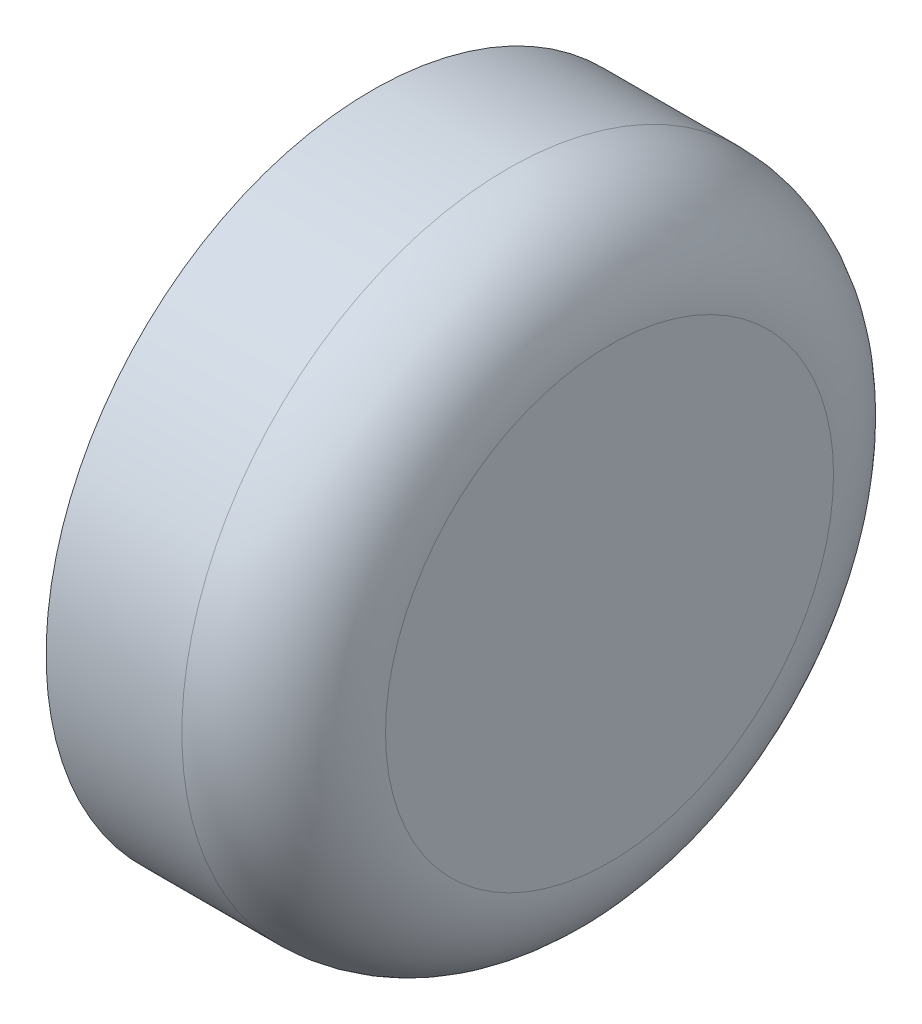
ISO-10303-21;
HEADER;
FILE_DESCRIPTION(('STEP AP214'),'2;1');
FILE_NAME('part.step','',(''),(''),'','','');
FILE_SCHEMA(('AUTOMOTIVE_DESIGN { 1 0 10303 214 1 1 1 1 }'));
ENDSEC;
DATA;
#1=APPLICATION_CONTEXT('core data for automotive mechanical design processes');
#2=APPLICATION_PROTOCOL_DEFINITION('international standard','automotive_design',2000,#1);
#3=PRODUCT_CONTEXT('',#1,'mechanical');
#4=PRODUCT('Part','Part','',(#3));
#5=PRODUCT_RELATED_PRODUCT_CATEGORY('part','',(#4));
#6=PRODUCT_DEFINITION_FORMATION('','',#4);
#7=PRODUCT_DEFINITION_CONTEXT('part definition',#1,'design');
#8=PRODUCT_DEFINITION('design','',#6,#7);
#9=PRODUCT_DEFINITION_SHAPE('','',#8);
#10=(LENGTH_UNIT() NAMED_UNIT(*) SI_UNIT(.MILLI.,.METRE.));
#11=(NAMED_UNIT(*) PLANE_ANGLE_UNIT() SI_UNIT($,.RADIAN.));
#12=(NAMED_UNIT(*) SI_UNIT($,.STERADIAN.) SOLID_ANGLE_UNIT());
#13=UNCERTAINTY_MEASURE_WITH_UNIT(LENGTH_MEASURE(1.E-05),#10,'distance_accuracy_value','');
#14=(GEOMETRIC_REPRESENTATION_CONTEXT(3) GLOBAL_UNCERTAINTY_ASSIGNED_CONTEXT((#13)) GLOBAL_UNIT_ASSIGNED_CONTEXT((#10,
#11,#12)) REPRESENTATION_CONTEXT('',''));
#15=CARTESIAN_POINT('',(0.,0.,0.));
#16=DIRECTION('',(0.,0.,1.));
#17=DIRECTION('',(1.,0.,0.));
#18=AXIS2_PLACEMENT_3D('',#15,#16,#17);
#19=CARTESIAN_POINT('',(6.319999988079,0.,1.5));
#20=DIRECTION('',(1.,0.,0.));
#21=DIRECTION('',(0.,0.,-1.));
#22=AXIS2_PLACEMENT_3D('',#19,#20,#21);
#23=PLANE('',#22);
#24=CARTESIAN_POINT('',(6.319999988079,0.,1.5));
#25=DIRECTION('',(-1.,0.,0.));
#26=DIRECTION('',(0.,0.,-1.));
#27=AXIS2_PLACEMENT_3D('',#24,#25,#26);
#28=CIRCLE('',#27,0.659999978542);
#29=CARTESIAN_POINT('',(6.319999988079,0.,0.840000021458));
#30=VERTEX_POINT('',#29);
#31=EDGE_CURVE('E24',#30,#30,#28,.T.);
#32=ORIENTED_EDGE('',*,*,#31,.F.);
#33=EDGE_LOOP('',(#32));
#34=FACE_BOUND('',#33,.T.);
#35=ADVANCED_FACE('F13',(#34),#23,.T.);
#36=CARTESIAN_POINT('',(6.019999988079,0.,1.5));
#37=DIRECTION('',(1.,0.,0.));
#38=DIRECTION('',(0.,0.,-1.));
#39=AXIS2_PLACEMENT_3D('',#36,#37,#38);
#40=TOROIDAL_SURFACE('',#39,0.659999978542,0.3);
#41=CARTESIAN_POINT('',(6.019999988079,0.,1.5));
#42=DIRECTION('',(1.,0.,0.));
#43=DIRECTION('',(0.,0.,-1.));
#44=AXIS2_PLACEMENT_3D('',#41,#42,#43);
#45=CIRCLE('',#44,0.959999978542);
#46=CARTESIAN_POINT('',(6.019999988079,0.,0.540000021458));
#47=VERTEX_POINT('',#46);
#48=EDGE_CURVE('E20',#47,#47,#45,.F.);
#49=ORIENTED_EDGE('',*,*,#48,.F.);
#50=EDGE_LOOP('',(#49));
#51=FACE_BOUND('',#50,.T.);
#52=ORIENTED_EDGE('',*,*,#31,.T.);
#53=EDGE_LOOP('',(#52));
#54=FACE_BOUND('',#53,.T.);
#55=ADVANCED_FACE('F34',(#51,#54),#40,.T.);
#56=CARTESIAN_POINT('',(5.62,0.,1.5));
#57=DIRECTION('',(1.,0.,0.));
#58=DIRECTION('',(0.,0.,-1.));
#59=AXIS2_PLACEMENT_3D('',#56,#57,#58);
#60=CYLINDRICAL_SURFACE('',#59,0.959999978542);
#61=ORIENTED_EDGE('',*,*,#48,.T.);
#62=EDGE_LOOP('',(#61));
#63=FACE_BOUND('',#62,.T.);
#64=CARTESIAN_POINT('',(5.62,0.,1.5));
#65=DIRECTION('',(1.,0.,0.));
#66=DIRECTION('',(0.,0.,-1.));
#67=AXIS2_PLACEMENT_3D('',#64,#65,#66);
#68=CIRCLE('',#67,0.959999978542);
#69=CARTESIAN_POINT('',(5.62,0.,0.540000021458));
#70=VERTEX_POINT('',#69);
#71=EDGE_CURVE('E9',#70,#70,#68,.T.);
#72=ORIENTED_EDGE('',*,*,#71,.T.);
#73=EDGE_LOOP('',(#72));
#74=FACE_BOUND('',#73,.T.);
#75=ADVANCED_FACE('F38',(#63,#74),#60,.T.);
#76=CARTESIAN_POINT('',(5.62,0.,1.5));
#77=DIRECTION('',(1.,0.,0.));
#78=DIRECTION('',(0.,0.,-1.));
#79=AXIS2_PLACEMENT_3D('',#76,#77,#78);
#80=PLANE('',#79);
#81=ORIENTED_EDGE('',*,*,#71,.F.);
#82=EDGE_LOOP('',(#81));
#83=FACE_BOUND('',#82,.T.);
#84=ADVANCED_FACE('F63',(#83),#80,.F.);
#85=CLOSED_SHELL('',(#35,#55,#75,#84));
#86=MANIFOLD_SOLID_BREP('B1',#85);
#87=ADVANCED_BREP_SHAPE_REPRESENTATION('',(#18,#86),#14);
#88=SHAPE_DEFINITION_REPRESENTATION(#9,#87);
ENDSEC;
END-ISO-10303-21;
